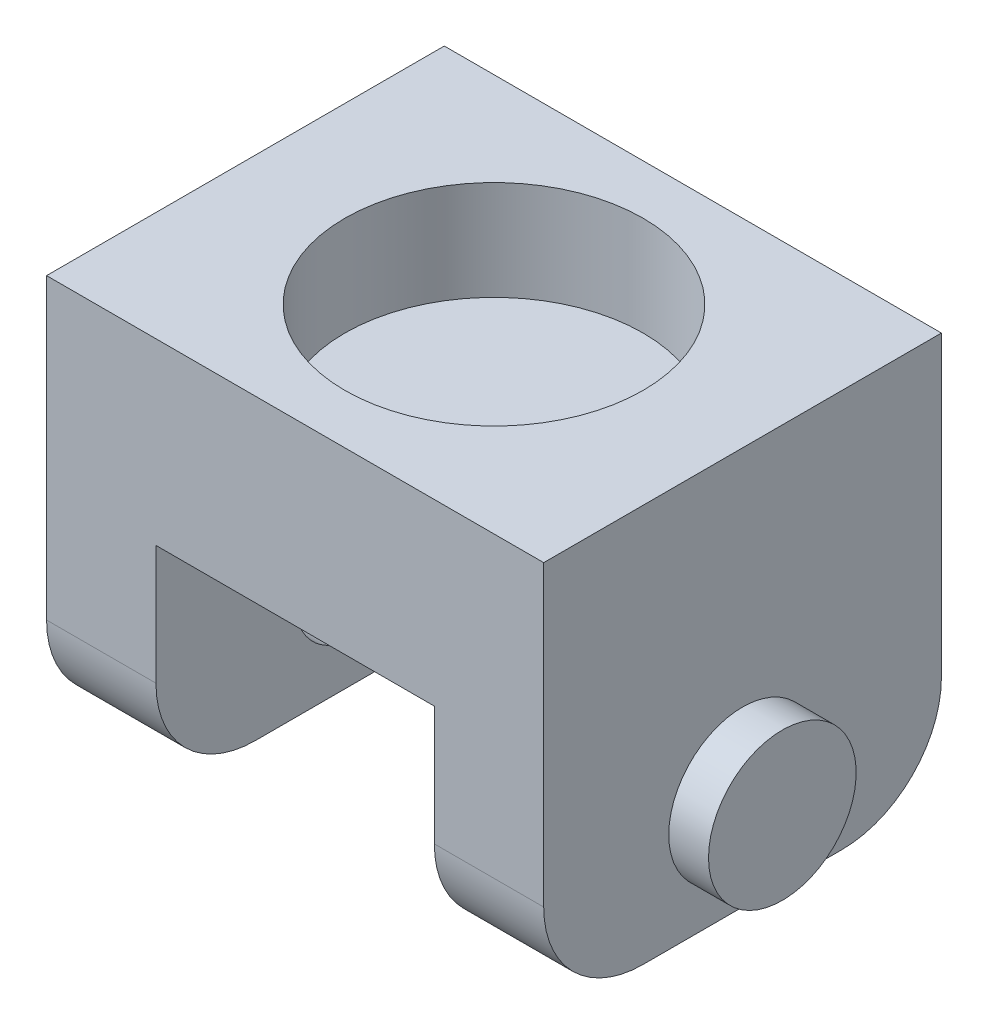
from build123d import *

# Parameters (mm, degrees)
CROQUIS1_W              = 25
CROQUIS1_H              = 20
SALIENTE_EXTRUIR1_DEPTH = 20
CROQUIS2_R              = 7.5
CORTAR_EXTRUIR1_DEPTH   = 5
CROQUIS4_W              = 14
CROQUIS4_H              = 22
CORTAR_EXTRUIR3_DEPTH   = 31.923292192
CROQUIS5_R              = 3
CORTAR_EXTRUIR4_DEPTH   = 34.541019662
REDONDEO1_R             = 5
CROQUIS6_R              = 3.712294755
SALIENTE_EXTRUIR2_DEPTH = 2


with BuildPart() as part:
    # Croquis1 → Saliente-Extruir1 (new body)
    with BuildSketch(Plane(origin=(0, 0, 0), x_dir=(1, 0, 0), z_dir=(0, 1, 0))):
        Rectangle(CROQUIS1_W, CROQUIS1_H)
    extrude(amount=SALIENTE_EXTRUIR1_DEPTH)

    # Croquis2 → Cortar-Extruir1 (cut)
    with BuildSketch(Plane(origin=(0, 20, 0), x_dir=(1, 0, 0), z_dir=(0, 1, 0))):
        with Locations(Location((0, 0, 0), (0, 0, 270))):
            Circle(CROQUIS2_R)
    extrude(amount=-CORTAR_EXTRUIR1_DEPTH, mode=Mode.SUBTRACT)

    # Croquis4 → Cortar-Extruir3 (cut, through all)
    with BuildSketch(Plane.XY.offset(10)):
        Rectangle(CROQUIS4_W, CROQUIS4_H)
    extrude(amount=-CORTAR_EXTRUIR3_DEPTH, mode=Mode.SUBTRACT)

    # Croquis5 → Cortar-Extruir4 (cut, through all)
    with BuildSketch(Plane.ZY.offset(12.5)):
        with Locations((0, 5)):
            Circle(CROQUIS5_R)
    extrude(amount=-CORTAR_EXTRUIR4_DEPTH, mode=Mode.SUBTRACT)

    # Redondeo1
    redondeo1_edges = [part.edges().sort_by_distance(p)[0] for p in [
        (9.75, 0, 10),
        (-9.75, 0, -10),
        (-9.75, 0, 10),
        (9.75, 0, -10),
    ]]
    fillet(redondeo1_edges, radius=REDONDEO1_R)

    # Croquis6 → Saliente-Extruir2 (add)
    with BuildSketch(Plane.ZY.offset(12.5)):
        with Locations(Location((0, 5, 0), (0, 0, 180))):
            Circle(CROQUIS6_R)
    saliente_extruir2 = extrude(amount=SALIENTE_EXTRUIR2_DEPTH)

    # Simetr_a1: Saliente-Extruir2 across plane
    add(saliente_extruir2.mirror(Plane(origin=(0, 0, 0), x_dir=(0, 0, 1), z_dir=(1, 0, 0))))


solid = part.part
